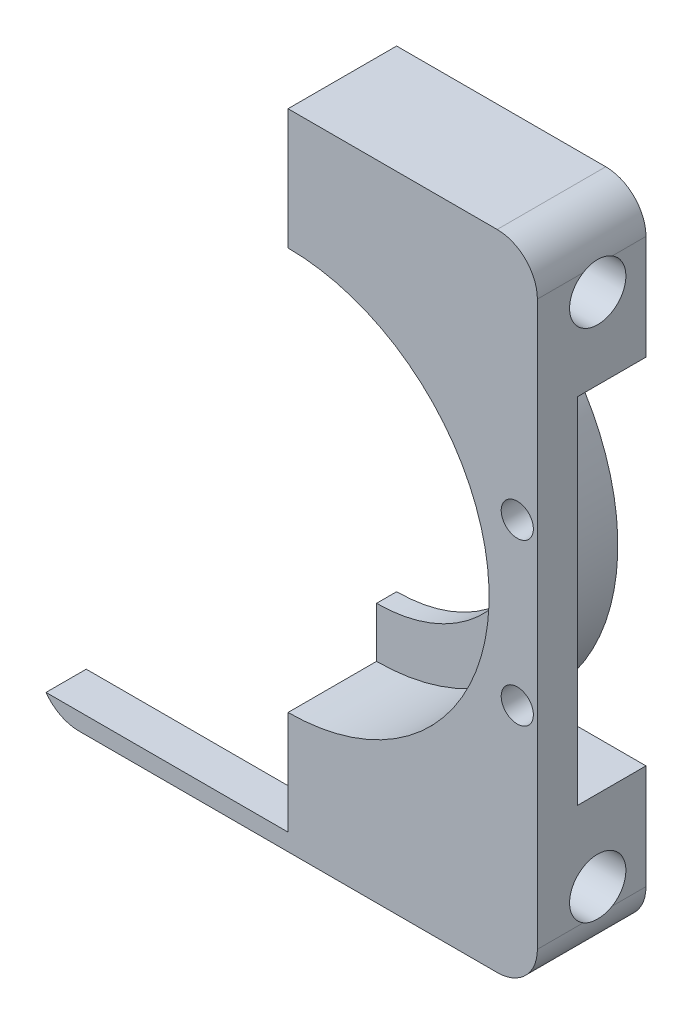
ISO-10303-21;
HEADER;
FILE_DESCRIPTION(('STEP AP214'),'2;1');
FILE_NAME('part.step','',(''),(''),'','','');
FILE_SCHEMA(('AUTOMOTIVE_DESIGN { 1 0 10303 214 1 1 1 1 }'));
ENDSEC;
DATA;
#1=APPLICATION_CONTEXT('core data for automotive mechanical design processes');
#2=APPLICATION_PROTOCOL_DEFINITION('international standard','automotive_design',2000,#1);
#3=PRODUCT_CONTEXT('',#1,'mechanical');
#4=PRODUCT('Part','Part','',(#3));
#5=PRODUCT_RELATED_PRODUCT_CATEGORY('part','',(#4));
#6=PRODUCT_DEFINITION_FORMATION('','',#4);
#7=PRODUCT_DEFINITION_CONTEXT('part definition',#1,'design');
#8=PRODUCT_DEFINITION('design','',#6,#7);
#9=PRODUCT_DEFINITION_SHAPE('','',#8);
#10=(LENGTH_UNIT() NAMED_UNIT(*) SI_UNIT(.MILLI.,.METRE.));
#11=(NAMED_UNIT(*) PLANE_ANGLE_UNIT() SI_UNIT($,.RADIAN.));
#12=(NAMED_UNIT(*) SI_UNIT($,.STERADIAN.) SOLID_ANGLE_UNIT());
#13=UNCERTAINTY_MEASURE_WITH_UNIT(LENGTH_MEASURE(1.E-05),#10,'distance_accuracy_value','');
#14=(GEOMETRIC_REPRESENTATION_CONTEXT(3) GLOBAL_UNCERTAINTY_ASSIGNED_CONTEXT((#13)) GLOBAL_UNIT_ASSIGNED_CONTEXT((#10,
#11,#12)) REPRESENTATION_CONTEXT('',''));
#15=CARTESIAN_POINT('',(0.,0.,0.));
#16=DIRECTION('',(0.,0.,1.));
#17=DIRECTION('',(1.,0.,0.));
#18=AXIS2_PLACEMENT_3D('',#15,#16,#17);
#19=CARTESIAN_POINT('',(0.,0.,0.));
#20=DIRECTION('',(1.,0.,0.));
#21=DIRECTION('',(0.,1.,0.));
#22=AXIS2_PLACEMENT_3D('',#19,#20,#21);
#23=PLANE('',#22);
#24=CARTESIAN_POINT('',(0.,310.713939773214,367.5));
#25=DIRECTION('',(-1.,0.,0.));
#26=DIRECTION('',(0.,1.,0.));
#27=AXIS2_PLACEMENT_3D('',#24,#25,#26);
#28=CIRCLE('',#27,6.99999999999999);
#29=CARTESIAN_POINT('',(0.,317.713939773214,367.5));
#30=VERTEX_POINT('',#29);
#31=EDGE_CURVE('E414',#30,#30,#28,.T.);
#32=ORIENTED_EDGE('',*,*,#31,.F.);
#33=EDGE_LOOP('',(#32));
#34=FACE_BOUND('',#33,.T.);
#35=DIRECTION('',(0.,1.,0.));
#36=VECTOR('',#35,1.);
#37=CARTESIAN_POINT('',(0.,444.713939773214,382.5));
#38=LINE('',#37,#36);
#39=CARTESIAN_POINT('',(0.,298.948444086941,382.5));
#40=VERTEX_POINT('',#39);
#41=CARTESIAN_POINT('',(0.,324.713939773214,382.5));
#42=VERTEX_POINT('',#41);
#43=EDGE_CURVE('E192',#40,#42,#38,.T.);
#44=ORIENTED_EDGE('',*,*,#43,.T.);
#45=DIRECTION('',(0.,0.,1.));
#46=VECTOR('',#45,1.);
#47=CARTESIAN_POINT('',(0.,324.713939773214,360.5));
#48=LINE('',#47,#46);
#49=CARTESIAN_POINT('',(0.,324.713939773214,360.5));
#50=VERTEX_POINT('',#49);
#51=EDGE_CURVE('E174',#42,#50,#48,.F.);
#52=ORIENTED_EDGE('',*,*,#51,.T.);
#53=DIRECTION('',(0.,-1.,0.));
#54=VECTOR('',#53,1.);
#55=CARTESIAN_POINT('',(0.,374.713939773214,360.5));
#56=LINE('',#55,#54);
#57=CARTESIAN_POINT('',(0.,337.213939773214,360.5));
#58=VERTEX_POINT('',#57);
#59=EDGE_CURVE('E352',#58,#50,#56,.T.);
#60=ORIENTED_EDGE('',*,*,#59,.F.);
#61=DIRECTION('',(0.,0.,1.));
#62=VECTOR('',#61,1.);
#63=CARTESIAN_POINT('',(0.,337.213939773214,355.5));
#64=LINE('',#63,#62);
#65=CARTESIAN_POINT('',(0.,337.213939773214,355.5));
#66=VERTEX_POINT('',#65);
#67=EDGE_CURVE('E355',#58,#66,#64,.F.);
#68=ORIENTED_EDGE('',*,*,#67,.T.);
#69=DIRECTION('',(0.,-1.,0.));
#70=VECTOR('',#69,1.);
#71=CARTESIAN_POINT('',(0.,374.713939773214,355.5));
#72=LINE('',#71,#70);
#73=CARTESIAN_POINT('',(0.,294.713939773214,355.5));
#74=VERTEX_POINT('',#73);
#75=EDGE_CURVE('E331',#66,#74,#72,.T.);
#76=ORIENTED_EDGE('',*,*,#75,.T.);
#77=DIRECTION('',(0.,0.,1.));
#78=VECTOR('',#77,1.);
#79=CARTESIAN_POINT('',(0.,294.713939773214,355.5));
#80=LINE('',#79,#78);
#81=CARTESIAN_POINT('',(0.,294.713939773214,372.5));
#82=VERTEX_POINT('',#81);
#83=EDGE_CURVE('E329',#74,#82,#80,.T.);
#84=ORIENTED_EDGE('',*,*,#83,.T.);
#85=DIRECTION('',(0.,1.,0.));
#86=VECTOR('',#85,1.);
#87=CARTESIAN_POINT('',(0.,319.713939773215,372.5));
#88=LINE('',#87,#86);
#89=CARTESIAN_POINT('',(0.,298.948444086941,372.5));
#90=VERTEX_POINT('',#89);
#91=EDGE_CURVE('E326',#82,#90,#88,.T.);
#92=ORIENTED_EDGE('',*,*,#91,.T.);
#93=DIRECTION('',(0.,0.,1.));
#94=VECTOR('',#93,1.);
#95=CARTESIAN_POINT('',(0.,298.948444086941,408.443763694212));
#96=LINE('',#95,#94);
#97=EDGE_CURVE('E200',#90,#40,#96,.T.);
#98=ORIENTED_EDGE('',*,*,#97,.T.);
#99=EDGE_LOOP('',(#44,#52,#60,#68,#76,#84,#92,#98));
#100=FACE_BOUND('',#99,.T.);
#101=ADVANCED_FACE('F45',(#34,#100),#23,.F.);
#102=CARTESIAN_POINT('',(-51.9999999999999,444.713939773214,372.5));
#103=DIRECTION('',(0.,0.,1.));
#104=DIRECTION('',(0.,-1.,0.));
#105=AXIS2_PLACEMENT_3D('',#102,#103,#104);
#106=PLANE('',#105);
#107=CARTESIAN_POINT('',(57.,394.713939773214,372.5));
#108=DIRECTION('',(0.,0.,-1.));
#109=DIRECTION('',(0.,1.,0.));
#110=AXIS2_PLACEMENT_3D('',#107,#108,#109);
#111=CIRCLE('',#110,4.00000000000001);
#112=CARTESIAN_POINT('',(57.,398.713939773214,372.5));
#113=VERTEX_POINT('',#112);
#114=EDGE_CURVE('E236',#113,#113,#111,.T.);
#115=ORIENTED_EDGE('',*,*,#114,.F.);
#116=EDGE_LOOP('',(#115));
#117=FACE_BOUND('',#116,.T.);
#118=CARTESIAN_POINT('',(57.,354.713939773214,372.5));
#119=DIRECTION('',(0.,0.,-1.));
#120=DIRECTION('',(0.,1.,0.));
#121=AXIS2_PLACEMENT_3D('',#118,#119,#120);
#122=CIRCLE('',#121,4.00000000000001);
#123=CARTESIAN_POINT('',(57.,358.713939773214,372.5));
#124=VERTEX_POINT('',#123);
#125=EDGE_CURVE('E228',#124,#124,#122,.T.);
#126=ORIENTED_EDGE('',*,*,#125,.F.);
#127=EDGE_LOOP('',(#126));
#128=FACE_BOUND('',#127,.T.);
#129=CARTESIAN_POINT('',(1.16120768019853E-13,374.713939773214,372.5));
#130=DIRECTION('',(0.,0.,1.));
#131=DIRECTION('',(0.,-1.,0.));
#132=AXIS2_PLACEMENT_3D('',#129,#130,#131);
#133=CIRCLE('',#132,55.);
#134=CARTESIAN_POINT('',(33.0000000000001,418.713939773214,372.5));
#135=VERTEX_POINT('',#134);
#136=CARTESIAN_POINT('',(33.0000000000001,330.713939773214,372.5));
#137=VERTEX_POINT('',#136);
#138=EDGE_CURVE('E185',#135,#137,#133,.F.);
#139=ORIENTED_EDGE('',*,*,#138,.F.);
#140=DIRECTION('',(1.,0.,0.));
#141=VECTOR('',#140,1.);
#142=CARTESIAN_POINT('',(62.0000000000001,418.713939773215,372.5));
#143=LINE('',#142,#141);
#144=CARTESIAN_POINT('',(62.0000000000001,418.713939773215,372.5));
#145=VERTEX_POINT('',#144);
#146=EDGE_CURVE('E563',#135,#145,#143,.T.);
#147=ORIENTED_EDGE('',*,*,#146,.T.);
#148=DIRECTION('',(0.,-1.,0.));
#149=VECTOR('',#148,1.);
#150=CARTESIAN_POINT('',(62.0000000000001,444.713939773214,372.5));
#151=LINE('',#150,#149);
#152=CARTESIAN_POINT('',(62.0000000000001,330.713939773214,372.5));
#153=VERTEX_POINT('',#152);
#154=EDGE_CURVE('E244',#145,#153,#151,.T.);
#155=ORIENTED_EDGE('',*,*,#154,.T.);
#156=DIRECTION('',(1.,0.,0.));
#157=VECTOR('',#156,1.);
#158=CARTESIAN_POINT('',(62.0000000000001,330.713939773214,372.5));
#159=LINE('',#158,#157);
#160=EDGE_CURVE('E387',#137,#153,#159,.T.);
#161=ORIENTED_EDGE('',*,*,#160,.F.);
#162=EDGE_LOOP('',(#139,#147,#155,#161));
#163=FACE_BOUND('',#162,.T.);
#164=ADVANCED_FACE('F480',(#117,#128,#163),#106,.F.);
#165=ORIENTED_EDGE('',*,*,#91,.F.);
#166=DIRECTION('',(-1.,0.,0.));
#167=VECTOR('',#166,1.);
#168=CARTESIAN_POINT('',(52.,294.713939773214,372.5));
#169=LINE('',#168,#167);
#170=CARTESIAN_POINT('',(-51.9999999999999,294.713939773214,372.5));
#171=VERTEX_POINT('',#170);
#172=EDGE_CURVE('E247',#82,#171,#169,.T.);
#173=ORIENTED_EDGE('',*,*,#172,.T.);
#174=CARTESIAN_POINT('',(-51.9999999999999,304.713939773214,372.5));
#175=DIRECTION('',(0.,0.,-1.));
#176=DIRECTION('',(0.,-1.,0.));
#177=AXIS2_PLACEMENT_3D('',#174,#175,#176);
#178=CIRCLE('',#177,10.);
#179=CARTESIAN_POINT('',(-60.1706217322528,298.948444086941,372.5));
#180=VERTEX_POINT('',#179);
#181=EDGE_CURVE('E251',#171,#180,#178,.T.);
#182=ORIENTED_EDGE('',*,*,#181,.T.);
#183=DIRECTION('',(-1.,0.,0.));
#184=VECTOR('',#183,1.);
#185=CARTESIAN_POINT('',(-52.,298.948444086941,372.5));
#186=LINE('',#185,#184);
#187=EDGE_CURVE('E206',#90,#180,#186,.T.);
#188=ORIENTED_EDGE('',*,*,#187,.F.);
#189=EDGE_LOOP('',(#165,#173,#182,#188));
#190=FACE_BOUND('',#189,.T.);
#191=ADVANCED_FACE('F325',(#190),#106,.F.);
#192=CARTESIAN_POINT('',(1.16120768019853E-13,374.713939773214,360.5));
#193=DIRECTION('',(0.,0.,1.));
#194=DIRECTION('',(0.,-1.,0.));
#195=AXIS2_PLACEMENT_3D('',#192,#193,#194);
#196=CYLINDRICAL_SURFACE('',#195,55.);
#197=CARTESIAN_POINT('',(1.16120768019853E-13,374.713939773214,355.5));
#198=DIRECTION('',(0.,0.,-1.));
#199=DIRECTION('',(0.,1.,0.));
#200=AXIS2_PLACEMENT_3D('',#197,#198,#199);
#201=CIRCLE('',#200,55.);
#202=CARTESIAN_POINT('',(33.,418.713939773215,355.5));
#203=VERTEX_POINT('',#202);
#204=CARTESIAN_POINT('',(33.0000000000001,330.713939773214,355.5));
#205=VERTEX_POINT('',#204);
#206=EDGE_CURVE('E219',#203,#205,#201,.T.);
#207=ORIENTED_EDGE('',*,*,#206,.F.);
#208=DIRECTION('',(0.,0.,1.));
#209=VECTOR('',#208,1.);
#210=CARTESIAN_POINT('',(33.0000000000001,418.713939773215,355.5));
#211=LINE('',#210,#209);
#212=EDGE_CURVE('E397',#203,#135,#211,.T.);
#213=ORIENTED_EDGE('',*,*,#212,.T.);
#214=ORIENTED_EDGE('',*,*,#138,.T.);
#215=DIRECTION('',(0.,0.,1.));
#216=VECTOR('',#215,1.);
#217=CARTESIAN_POINT('',(33.0000000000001,330.713939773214,355.5));
#218=LINE('',#217,#216);
#219=EDGE_CURVE('E340',#205,#137,#218,.T.);
#220=ORIENTED_EDGE('',*,*,#219,.F.);
#221=EDGE_LOOP('',(#207,#213,#214,#220));
#222=FACE_BOUND('',#221,.T.);
#223=ADVANCED_FACE('F469',(#222),#196,.T.);
#224=CARTESIAN_POINT('',(-51.9999999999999,444.713939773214,382.5));
#225=DIRECTION('',(0.,0.,1.));
#226=DIRECTION('',(0.,-1.,0.));
#227=AXIS2_PLACEMENT_3D('',#224,#225,#226);
#228=PLANE('',#227);
#229=CARTESIAN_POINT('',(1.16120768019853E-13,374.713939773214,382.5));
#230=DIRECTION('',(0.,0.,-1.));
#231=DIRECTION('',(0.,1.,0.));
#232=AXIS2_PLACEMENT_3D('',#229,#230,#231);
#233=CIRCLE('',#232,50.);
#234=CARTESIAN_POINT('',(0.,424.713939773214,382.5));
#235=VERTEX_POINT('',#234);
#236=EDGE_CURVE('E177',#235,#42,#233,.T.);
#237=ORIENTED_EDGE('',*,*,#236,.T.);
#238=ORIENTED_EDGE('',*,*,#43,.F.);
#239=DIRECTION('',(-1.,0.,0.));
#240=VECTOR('',#239,1.);
#241=CARTESIAN_POINT('',(-52.,298.948444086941,382.5));
#242=LINE('',#241,#240);
#243=CARTESIAN_POINT('',(-60.1706217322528,298.948444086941,382.5));
#244=VERTEX_POINT('',#243);
#245=EDGE_CURVE('E202',#40,#244,#242,.T.);
#246=ORIENTED_EDGE('',*,*,#245,.T.);
#247=CARTESIAN_POINT('',(-51.9999999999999,304.713939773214,382.5));
#248=DIRECTION('',(0.,0.,-1.));
#249=DIRECTION('',(0.,-1.,0.));
#250=AXIS2_PLACEMENT_3D('',#247,#248,#249);
#251=CIRCLE('',#250,10.);
#252=CARTESIAN_POINT('',(-51.9999999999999,294.713939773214,382.5));
#253=VERTEX_POINT('',#252);
#254=EDGE_CURVE('E248',#253,#244,#251,.T.);
#255=ORIENTED_EDGE('',*,*,#254,.F.);
#256=DIRECTION('',(-1.,0.,0.));
#257=VECTOR('',#256,1.);
#258=CARTESIAN_POINT('',(52.,294.713939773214,382.5));
#259=LINE('',#258,#257);
#260=CARTESIAN_POINT('',(52.,294.713939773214,382.5));
#261=VERTEX_POINT('',#260);
#262=EDGE_CURVE('E269',#261,#253,#259,.T.);
#263=ORIENTED_EDGE('',*,*,#262,.F.);
#264=CARTESIAN_POINT('',(52.,304.713939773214,382.5));
#265=DIRECTION('',(0.,0.,-1.));
#266=DIRECTION('',(0.,-1.,0.));
#267=AXIS2_PLACEMENT_3D('',#264,#265,#266);
#268=CIRCLE('',#267,10.);
#269=CARTESIAN_POINT('',(62.0000000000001,304.713939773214,382.5));
#270=VERTEX_POINT('',#269);
#271=EDGE_CURVE('E266',#270,#261,#268,.T.);
#272=ORIENTED_EDGE('',*,*,#271,.F.);
#273=DIRECTION('',(0.,-1.,0.));
#274=VECTOR('',#273,1.);
#275=CARTESIAN_POINT('',(62.0000000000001,444.713939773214,382.5));
#276=LINE('',#275,#274);
#277=CARTESIAN_POINT('',(62.0000000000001,444.713939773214,382.5));
#278=VERTEX_POINT('',#277);
#279=EDGE_CURVE('E262',#278,#270,#276,.T.);
#280=ORIENTED_EDGE('',*,*,#279,.F.);
#281=CARTESIAN_POINT('',(52.0000000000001,444.713939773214,382.5));
#282=DIRECTION('',(0.,0.,-1.));
#283=DIRECTION('',(0.,-1.,0.));
#284=AXIS2_PLACEMENT_3D('',#281,#282,#283);
#285=CIRCLE('',#284,10.);
#286=CARTESIAN_POINT('',(52.0000000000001,454.713939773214,382.5));
#287=VERTEX_POINT('',#286);
#288=EDGE_CURVE('E258',#287,#278,#285,.T.);
#289=ORIENTED_EDGE('',*,*,#288,.F.);
#290=DIRECTION('',(1.,0.,0.));
#291=VECTOR('',#290,1.);
#292=CARTESIAN_POINT('',(52.0000000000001,454.713939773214,382.5));
#293=LINE('',#292,#291);
#294=CARTESIAN_POINT('',(0.,454.713939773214,382.5));
#295=VERTEX_POINT('',#294);
#296=EDGE_CURVE('E240',#295,#287,#293,.T.);
#297=ORIENTED_EDGE('',*,*,#296,.F.);
#298=EDGE_CURVE('E194',#235,#295,#38,.T.);
#299=ORIENTED_EDGE('',*,*,#298,.F.);
#300=EDGE_LOOP('',(#237,#238,#246,#255,#263,#272,#280,#289,#297,#299));
#301=FACE_BOUND('',#300,.T.);
#302=CARTESIAN_POINT('',(57.,394.713939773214,382.5));
#303=DIRECTION('',(0.,0.,-1.));
#304=DIRECTION('',(0.,1.,0.));
#305=AXIS2_PLACEMENT_3D('',#302,#303,#304);
#306=CIRCLE('',#305,4.00000000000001);
#307=CARTESIAN_POINT('',(57.,398.713939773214,382.5));
#308=VERTEX_POINT('',#307);
#309=EDGE_CURVE('E232',#308,#308,#306,.T.);
#310=ORIENTED_EDGE('',*,*,#309,.T.);
#311=EDGE_LOOP('',(#310));
#312=FACE_BOUND('',#311,.T.);
#313=CARTESIAN_POINT('',(57.,354.713939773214,382.5));
#314=DIRECTION('',(0.,0.,-1.));
#315=DIRECTION('',(0.,1.,0.));
#316=AXIS2_PLACEMENT_3D('',#313,#314,#315);
#317=CIRCLE('',#316,4.00000000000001);
#318=CARTESIAN_POINT('',(57.,358.713939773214,382.5));
#319=VERTEX_POINT('',#318);
#320=EDGE_CURVE('E227',#319,#319,#317,.T.);
#321=ORIENTED_EDGE('',*,*,#320,.T.);
#322=EDGE_LOOP('',(#321));
#323=FACE_BOUND('',#322,.T.);
#324=ADVANCED_FACE('F189',(#301,#312,#323),#228,.T.);
#325=CARTESIAN_POINT('',(-51.9999999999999,304.713939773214,372.5));
#326=DIRECTION('',(0.,0.,1.));
#327=DIRECTION('',(0.,-1.,0.));
#328=AXIS2_PLACEMENT_3D('',#325,#326,#327);
#329=CYLINDRICAL_SURFACE('',#328,10.);
#330=DIRECTION('',(0.,0.,1.));
#331=VECTOR('',#330,1.);
#332=CARTESIAN_POINT('',(-60.1706217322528,298.948444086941,372.5));
#333=LINE('',#332,#331);
#334=EDGE_CURVE('E11',#180,#244,#333,.T.);
#335=ORIENTED_EDGE('',*,*,#334,.F.);
#336=ORIENTED_EDGE('',*,*,#181,.F.);
#337=DIRECTION('',(0.,0.,1.));
#338=VECTOR('',#337,1.);
#339=CARTESIAN_POINT('',(-51.9999999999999,294.713939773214,372.5));
#340=LINE('',#339,#338);
#341=EDGE_CURVE('E255',#171,#253,#340,.T.);
#342=ORIENTED_EDGE('',*,*,#341,.T.);
#343=ORIENTED_EDGE('',*,*,#254,.T.);
#344=EDGE_LOOP('',(#335,#336,#342,#343));
#345=FACE_BOUND('',#344,.T.);
#346=ADVANCED_FACE('F322',(#345),#329,.T.);
#347=CARTESIAN_POINT('',(52.0000000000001,454.713939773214,372.5));
#348=DIRECTION('',(0.,-1.,0.));
#349=DIRECTION('',(0.,0.,-1.));
#350=AXIS2_PLACEMENT_3D('',#347,#348,#349);
#351=PLANE('',#350);
#352=DIRECTION('',(0.,0.,1.));
#353=VECTOR('',#352,1.);
#354=CARTESIAN_POINT('',(52.0000000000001,454.713939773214,372.5));
#355=LINE('',#354,#353);
#356=CARTESIAN_POINT('',(52.,454.713939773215,355.5));
#357=VERTEX_POINT('',#356);
#358=EDGE_CURVE('E292',#357,#287,#355,.T.);
#359=ORIENTED_EDGE('',*,*,#358,.F.);
#360=DIRECTION('',(-1.,0.,0.));
#361=VECTOR('',#360,1.);
#362=CARTESIAN_POINT('',(52.,454.713939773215,355.5));
#363=LINE('',#362,#361);
#364=CARTESIAN_POINT('',(0.,454.713939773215,355.5));
#365=VERTEX_POINT('',#364);
#366=EDGE_CURVE('E573',#357,#365,#363,.T.);
#367=ORIENTED_EDGE('',*,*,#366,.T.);
#368=DIRECTION('',(0.,0.,1.));
#369=VECTOR('',#368,1.);
#370=CARTESIAN_POINT('',(0.,454.713939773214,372.5));
#371=LINE('',#370,#369);
#372=EDGE_CURVE('E208',#365,#295,#371,.T.);
#373=ORIENTED_EDGE('',*,*,#372,.T.);
#374=ORIENTED_EDGE('',*,*,#296,.T.);
#375=EDGE_LOOP('',(#359,#367,#373,#374));
#376=FACE_BOUND('',#375,.T.);
#377=ADVANCED_FACE('F47',(#376),#351,.F.);
#378=CARTESIAN_POINT('',(52.0000000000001,444.713939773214,372.5));
#379=DIRECTION('',(0.,0.,1.));
#380=DIRECTION('',(0.,-1.,0.));
#381=AXIS2_PLACEMENT_3D('',#378,#379,#380);
#382=CYLINDRICAL_SURFACE('',#381,10.);
#383=DIRECTION('',(0.,0.,1.));
#384=VECTOR('',#383,1.);
#385=CARTESIAN_POINT('',(62.0000000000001,444.713939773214,372.5));
#386=LINE('',#385,#384);
#387=CARTESIAN_POINT('',(62.0000000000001,444.713939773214,371.105551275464));
#388=VERTEX_POINT('',#387);
#389=EDGE_CURVE('E287',#388,#278,#386,.T.);
#390=ORIENTED_EDGE('',*,*,#389,.F.);
#391=CARTESIAN_POINT('',(62.0000000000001,444.713939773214,371.105551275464));
#392=CARTESIAN_POINT('',(61.9999752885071,444.815282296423,370.936947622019));
#393=CARTESIAN_POINT('',(61.9984580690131,444.909473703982,370.764065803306));
#394=CARTESIAN_POINT('',(61.9935720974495,445.082967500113,370.411028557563));
#395=CARTESIAN_POINT('',(61.9902035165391,445.162271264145,370.230873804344));
#396=CARTESIAN_POINT('',(61.9827512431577,445.30535739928,369.864706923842));
#397=CARTESIAN_POINT('',(61.9786681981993,445.369153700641,369.678700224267));
#398=CARTESIAN_POINT('',(61.9707047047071,445.480879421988,369.301977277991));
#399=CARTESIAN_POINT('',(61.966824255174,445.528808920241,369.111261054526));
#400=CARTESIAN_POINT('',(61.9599902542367,445.608475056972,368.72638412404));
#401=CARTESIAN_POINT('',(61.9570370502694,445.64020562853,368.532222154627));
#402=CARTESIAN_POINT('',(61.9525519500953,445.687217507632,368.141900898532));
#403=CARTESIAN_POINT('',(61.9510200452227,445.702498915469,367.945741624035));
#404=CARTESIAN_POINT('',(61.9496190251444,445.716502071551,367.552777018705));
#405=CARTESIAN_POINT('',(61.9497503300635,445.715219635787,367.355971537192));
#406=CARTESIAN_POINT('',(61.9516563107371,445.696094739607,366.963183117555));
#407=CARTESIAN_POINT('',(61.9534309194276,445.678252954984,366.767200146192));
#408=CARTESIAN_POINT('',(61.9583361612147,445.626201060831,366.377892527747));
#409=CARTESIAN_POINT('',(61.9614637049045,445.5920282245,366.184562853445));
#410=CARTESIAN_POINT('',(61.9685479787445,445.507567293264,365.801439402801));
#411=CARTESIAN_POINT('',(61.972504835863,445.457276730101,365.611646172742));
#412=CARTESIAN_POINT('',(61.9804880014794,445.341032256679,365.237255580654));
#413=CARTESIAN_POINT('',(61.9845141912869,445.275103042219,365.052650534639));
#414=CARTESIAN_POINT('',(61.9916941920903,445.128019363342,364.689681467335));
#415=CARTESIAN_POINT('',(61.9948485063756,445.04687372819,364.511313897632));
#416=CARTESIAN_POINT('',(61.9979423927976,444.92032412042,364.261496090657));
#417=CARTESIAN_POINT('',(61.9986897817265,444.880874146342,364.186990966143));
#418=CARTESIAN_POINT('',(61.9997180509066,444.799362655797,364.039550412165));
#419=CARTESIAN_POINT('',(61.9999995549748,444.757304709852,363.966613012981));
#420=CARTESIAN_POINT('',(62.0000000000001,444.713939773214,363.894448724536));
#421=B_SPLINE_CURVE_WITH_KNOTS('',3,(#391,#392,#393,#394,#395,#396,#397,#398,#399,#400,#401,
#402,#403,#404,#405,#406,#407,#408,#409,#410,#411,#412,#413,#414,#415,#416,#417,#418,#419,#420),
.UNSPECIFIED.,.F.,.F.,(4,2,2,2,2,2,2,2,2,2,2,2,2,2,4),(0.,0.589946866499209,1.17983920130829,
1.76919966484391,2.35855722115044,2.94813534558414,3.53770987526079,4.12743333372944,
4.71713272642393,5.30549259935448,5.8939426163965,6.48146949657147,7.06865651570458,
7.32153490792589,7.57407442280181),.UNSPECIFIED.);
#422=CARTESIAN_POINT('',(62.0000000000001,444.713939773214,363.894448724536));
#423=VERTEX_POINT('',#422);
#424=EDGE_CURVE('E67',#388,#423,#421,.T.);
#425=ORIENTED_EDGE('',*,*,#424,.T.);
#426=CARTESIAN_POINT('',(62.0000000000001,444.713939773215,355.5));
#427=VERTEX_POINT('',#426);
#428=EDGE_CURVE('E288',#427,#423,#386,.T.);
#429=ORIENTED_EDGE('',*,*,#428,.F.);
#430=CARTESIAN_POINT('',(52.,444.713939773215,355.5));
#431=DIRECTION('',(0.,0.,1.));
#432=DIRECTION('',(0.,-1.,0.));
#433=AXIS2_PLACEMENT_3D('',#430,#431,#432);
#434=CIRCLE('',#433,10.);
#435=EDGE_CURVE('E568',#427,#357,#434,.T.);
#436=ORIENTED_EDGE('',*,*,#435,.T.);
#437=ORIENTED_EDGE('',*,*,#358,.T.);
#438=ORIENTED_EDGE('',*,*,#288,.T.);
#439=EDGE_LOOP('',(#390,#425,#429,#436,#437,#438));
#440=FACE_BOUND('',#439,.T.);
#441=ADVANCED_FACE('F559',(#440),#382,.T.);
#442=CARTESIAN_POINT('',(62.0000000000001,444.713939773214,372.5));
#443=DIRECTION('',(-1.,0.,0.));
#444=DIRECTION('',(0.,-1.,0.));
#445=AXIS2_PLACEMENT_3D('',#442,#443,#444);
#446=PLANE('',#445);
#447=ORIENTED_EDGE('',*,*,#428,.T.);
#448=CARTESIAN_POINT('',(62.0000000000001,438.713939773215,367.5));
#449=DIRECTION('',(-1.,0.,0.));
#450=DIRECTION('',(0.,-1.,0.));
#451=AXIS2_PLACEMENT_3D('',#448,#449,#450);
#452=CIRCLE('',#451,6.99999999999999);
#453=EDGE_CURVE('E430',#423,#388,#452,.T.);
#454=ORIENTED_EDGE('',*,*,#453,.T.);
#455=ORIENTED_EDGE('',*,*,#389,.T.);
#456=ORIENTED_EDGE('',*,*,#279,.T.);
#457=DIRECTION('',(0.,0.,1.));
#458=VECTOR('',#457,1.);
#459=CARTESIAN_POINT('',(62.0000000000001,304.713939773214,372.5));
#460=LINE('',#459,#458);
#461=CARTESIAN_POINT('',(62.0000000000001,304.713939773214,371.105551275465));
#462=VERTEX_POINT('',#461);
#463=EDGE_CURVE('E282',#462,#270,#460,.T.);
#464=ORIENTED_EDGE('',*,*,#463,.F.);
#465=CARTESIAN_POINT('',(62.0000000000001,310.713939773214,367.5));
#466=DIRECTION('',(-1.,0.,0.));
#467=DIRECTION('',(0.,1.,0.));
#468=AXIS2_PLACEMENT_3D('',#465,#466,#467);
#469=CIRCLE('',#468,6.99999999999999);
#470=CARTESIAN_POINT('',(62.0000000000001,304.713939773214,363.894448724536));
#471=VERTEX_POINT('',#470);
#472=EDGE_CURVE('E196',#462,#471,#469,.T.);
#473=ORIENTED_EDGE('',*,*,#472,.T.);
#474=CARTESIAN_POINT('',(62.0000000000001,304.713939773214,355.5));
#475=VERTEX_POINT('',#474);
#476=EDGE_CURVE('E283',#475,#471,#460,.T.);
#477=ORIENTED_EDGE('',*,*,#476,.F.);
#478=DIRECTION('',(0.,-1.,0.));
#479=VECTOR('',#478,1.);
#480=CARTESIAN_POINT('',(62.0000000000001,304.713939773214,355.5));
#481=LINE('',#480,#479);
#482=CARTESIAN_POINT('',(62.0000000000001,330.713939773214,355.5));
#483=VERTEX_POINT('',#482);
#484=EDGE_CURVE('E380',#483,#475,#481,.T.);
#485=ORIENTED_EDGE('',*,*,#484,.F.);
#486=DIRECTION('',(0.,0.,1.));
#487=VECTOR('',#486,1.);
#488=CARTESIAN_POINT('',(62.0000000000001,330.713939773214,355.5));
#489=LINE('',#488,#487);
#490=EDGE_CURVE('E334',#483,#153,#489,.T.);
#491=ORIENTED_EDGE('',*,*,#490,.T.);
#492=ORIENTED_EDGE('',*,*,#154,.F.);
#493=DIRECTION('',(0.,0.,1.));
#494=VECTOR('',#493,1.);
#495=CARTESIAN_POINT('',(62.0000000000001,418.713939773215,355.5));
#496=LINE('',#495,#494);
#497=CARTESIAN_POINT('',(62.0000000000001,418.713939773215,355.5));
#498=VERTEX_POINT('',#497);
#499=EDGE_CURVE('E390',#498,#145,#496,.T.);
#500=ORIENTED_EDGE('',*,*,#499,.F.);
#501=DIRECTION('',(0.,1.,0.));
#502=VECTOR('',#501,1.);
#503=CARTESIAN_POINT('',(62.0000000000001,444.713939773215,355.5));
#504=LINE('',#503,#502);
#505=EDGE_CURVE('E566',#498,#427,#504,.T.);
#506=ORIENTED_EDGE('',*,*,#505,.T.);
#507=EDGE_LOOP('',(#447,#454,#455,#456,#464,#473,#477,#485,#491,#492,#500,#506));
#508=FACE_BOUND('',#507,.T.);
#509=ADVANCED_FACE('F309',(#508),#446,.F.);
#510=CARTESIAN_POINT('',(52.,304.713939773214,372.5));
#511=DIRECTION('',(0.,0.,1.));
#512=DIRECTION('',(0.,-1.,0.));
#513=AXIS2_PLACEMENT_3D('',#510,#511,#512);
#514=CYLINDRICAL_SURFACE('',#513,10.);
#515=ORIENTED_EDGE('',*,*,#476,.T.);
#516=CARTESIAN_POINT('',(62.0000000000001,304.713939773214,363.894448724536));
#517=CARTESIAN_POINT('',(61.9999752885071,304.612597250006,364.063052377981));
#518=CARTESIAN_POINT('',(61.9984580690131,304.518405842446,364.235934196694));
#519=CARTESIAN_POINT('',(61.9935720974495,304.344912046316,364.588971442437));
#520=CARTESIAN_POINT('',(61.9902035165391,304.265608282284,364.769126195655));
#521=CARTESIAN_POINT('',(61.9827512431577,304.122522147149,365.135293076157));
#522=CARTESIAN_POINT('',(61.9786681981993,304.058725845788,365.321299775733));
#523=CARTESIAN_POINT('',(61.9707047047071,303.947000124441,365.698022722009));
#524=CARTESIAN_POINT('',(61.966824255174,303.899070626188,365.888738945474));
#525=CARTESIAN_POINT('',(61.9599902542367,303.819404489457,366.27361587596));
#526=CARTESIAN_POINT('',(61.9570370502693,303.787673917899,366.467777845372));
#527=CARTESIAN_POINT('',(61.9525519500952,303.740662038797,366.858099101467));
#528=CARTESIAN_POINT('',(61.9510200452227,303.72538063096,367.054258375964));
#529=CARTESIAN_POINT('',(61.9496190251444,303.711377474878,367.447222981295));
#530=CARTESIAN_POINT('',(61.9497503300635,303.712659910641,367.644028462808));
#531=CARTESIAN_POINT('',(61.951656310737,303.731784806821,368.036816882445));
#532=CARTESIAN_POINT('',(61.9534309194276,303.749626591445,368.232799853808));
#533=CARTESIAN_POINT('',(61.9583361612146,303.801678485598,368.622107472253));
#534=CARTESIAN_POINT('',(61.9614637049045,303.835851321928,368.815437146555));
#535=CARTESIAN_POINT('',(61.9685479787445,303.920312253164,369.198560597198));
#536=CARTESIAN_POINT('',(61.972504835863,303.970602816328,369.388353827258));
#537=CARTESIAN_POINT('',(61.9804880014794,304.08684728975,369.762744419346));
#538=CARTESIAN_POINT('',(61.9845141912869,304.15277650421,369.947349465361));
#539=CARTESIAN_POINT('',(61.9916941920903,304.299860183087,370.310318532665));
#540=CARTESIAN_POINT('',(61.9948485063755,304.381005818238,370.488686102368));
#541=CARTESIAN_POINT('',(61.9979423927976,304.507555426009,370.738503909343));
#542=CARTESIAN_POINT('',(61.9986897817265,304.547005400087,370.813009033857));
#543=CARTESIAN_POINT('',(61.9997180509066,304.628516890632,370.960449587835));
#544=CARTESIAN_POINT('',(61.9999995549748,304.670574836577,371.03338698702));
#545=CARTESIAN_POINT('',(62.0000000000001,304.713939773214,371.105551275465));
#546=B_SPLINE_CURVE_WITH_KNOTS('',3,(#516,#517,#518,#519,#520,#521,#522,#523,#524,#525,#526,
#527,#528,#529,#530,#531,#532,#533,#534,#535,#536,#537,#538,#539,#540,#541,#542,#543,#544,#545),
.UNSPECIFIED.,.F.,.F.,(4,2,2,2,2,2,2,2,2,2,2,2,2,2,4),(0.,0.589946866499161,1.17983920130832,
1.76919966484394,2.35855722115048,2.94813534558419,3.5377098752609,4.12743333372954,
4.71713272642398,5.30549259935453,5.89394261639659,6.48146949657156,7.06865651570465,
7.32153490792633,7.5740744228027),.UNSPECIFIED.);
#547=EDGE_CURVE('E305',#471,#462,#546,.T.);
#548=ORIENTED_EDGE('',*,*,#547,.T.);
#549=ORIENTED_EDGE('',*,*,#463,.T.);
#550=ORIENTED_EDGE('',*,*,#271,.T.);
#551=DIRECTION('',(0.,0.,1.));
#552=VECTOR('',#551,1.);
#553=CARTESIAN_POINT('',(52.,294.713939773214,372.5));
#554=LINE('',#553,#552);
#555=CARTESIAN_POINT('',(52.,294.713939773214,355.5));
#556=VERTEX_POINT('',#555);
#557=EDGE_CURVE('E278',#556,#261,#554,.T.);
#558=ORIENTED_EDGE('',*,*,#557,.F.);
#559=CARTESIAN_POINT('',(52.,304.713939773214,355.5));
#560=DIRECTION('',(0.,0.,-1.));
#561=DIRECTION('',(0.,1.,0.));
#562=AXIS2_PLACEMENT_3D('',#559,#560,#561);
#563=CIRCLE('',#562,10.);
#564=EDGE_CURVE('E342',#475,#556,#563,.T.);
#565=ORIENTED_EDGE('',*,*,#564,.F.);
#566=EDGE_LOOP('',(#515,#548,#549,#550,#558,#565));
#567=FACE_BOUND('',#566,.T.);
#568=ADVANCED_FACE('F303',(#567),#514,.T.);
#569=CARTESIAN_POINT('',(52.,294.713939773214,372.5));
#570=DIRECTION('',(0.,1.,0.));
#571=DIRECTION('',(0.,0.,1.));
#572=AXIS2_PLACEMENT_3D('',#569,#570,#571);
#573=PLANE('',#572);
#574=ORIENTED_EDGE('',*,*,#262,.T.);
#575=ORIENTED_EDGE('',*,*,#341,.F.);
#576=ORIENTED_EDGE('',*,*,#172,.F.);
#577=ORIENTED_EDGE('',*,*,#83,.F.);
#578=DIRECTION('',(-1.,0.,0.));
#579=VECTOR('',#578,1.);
#580=CARTESIAN_POINT('',(52.,294.713939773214,355.5));
#581=LINE('',#580,#579);
#582=EDGE_CURVE('E335',#556,#74,#581,.T.);
#583=ORIENTED_EDGE('',*,*,#582,.F.);
#584=ORIENTED_EDGE('',*,*,#557,.T.);
#585=EDGE_LOOP('',(#574,#575,#576,#577,#583,#584));
#586=FACE_BOUND('',#585,.T.);
#587=ADVANCED_FACE('F316',(#586),#573,.F.);
#588=CARTESIAN_POINT('',(57.,394.713939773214,372.5));
#589=DIRECTION('',(0.,0.,1.));
#590=DIRECTION('',(0.,-1.,0.));
#591=AXIS2_PLACEMENT_3D('',#588,#589,#590);
#592=CYLINDRICAL_SURFACE('',#591,4.00000000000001);
#593=ORIENTED_EDGE('',*,*,#114,.T.);
#594=EDGE_LOOP('',(#593));
#595=FACE_BOUND('',#594,.T.);
#596=ORIENTED_EDGE('',*,*,#309,.F.);
#597=EDGE_LOOP('',(#596));
#598=FACE_BOUND('',#597,.T.);
#599=ADVANCED_FACE('F475',(#595,#598),#592,.F.);
#600=CARTESIAN_POINT('',(57.,354.713939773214,372.5));
#601=DIRECTION('',(0.,0.,1.));
#602=DIRECTION('',(0.,-1.,0.));
#603=AXIS2_PLACEMENT_3D('',#600,#601,#602);
#604=CYLINDRICAL_SURFACE('',#603,4.00000000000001);
#605=ORIENTED_EDGE('',*,*,#125,.T.);
#606=EDGE_LOOP('',(#605));
#607=FACE_BOUND('',#606,.T.);
#608=ORIENTED_EDGE('',*,*,#320,.F.);
#609=EDGE_LOOP('',(#608));
#610=FACE_BOUND('',#609,.T.);
#611=ADVANCED_FACE('F466',(#607,#610),#604,.F.);
#612=CARTESIAN_POINT('',(1.16120768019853E-13,374.713939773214,360.5));
#613=DIRECTION('',(0.,0.,-1.));
#614=DIRECTION('',(0.,1.,0.));
#615=AXIS2_PLACEMENT_3D('',#612,#613,#614);
#616=PLANE('',#615);
#617=CARTESIAN_POINT('',(1.16120768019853E-13,374.713939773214,360.5));
#618=DIRECTION('',(0.,0.,-1.));
#619=DIRECTION('',(0.,1.,0.));
#620=AXIS2_PLACEMENT_3D('',#617,#618,#619);
#621=CIRCLE('',#620,50.);
#622=CARTESIAN_POINT('',(0.,424.713939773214,360.5));
#623=VERTEX_POINT('',#622);
#624=EDGE_CURVE('E180',#623,#50,#621,.T.);
#625=ORIENTED_EDGE('',*,*,#624,.F.);
#626=CARTESIAN_POINT('',(0.,412.213939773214,360.5));
#627=VERTEX_POINT('',#626);
#628=EDGE_CURVE('E356',#623,#627,#56,.T.);
#629=ORIENTED_EDGE('',*,*,#628,.T.);
#630=CARTESIAN_POINT('',(1.16120768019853E-13,374.713939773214,360.5));
#631=DIRECTION('',(0.,0.,-1.));
#632=DIRECTION('',(0.,1.,0.));
#633=AXIS2_PLACEMENT_3D('',#630,#631,#632);
#634=CIRCLE('',#633,37.5);
#635=EDGE_CURVE('E214',#627,#58,#634,.T.);
#636=ORIENTED_EDGE('',*,*,#635,.T.);
#637=ORIENTED_EDGE('',*,*,#59,.T.);
#638=EDGE_LOOP('',(#625,#629,#636,#637));
#639=FACE_BOUND('',#638,.T.);
#640=ADVANCED_FACE('F369',(#639),#616,.F.);
#641=CARTESIAN_POINT('',(1.16120768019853E-13,374.713939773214,355.5));
#642=DIRECTION('',(0.,0.,-1.));
#643=DIRECTION('',(0.,1.,0.));
#644=AXIS2_PLACEMENT_3D('',#641,#642,#643);
#645=PLANE('',#644);
#646=CARTESIAN_POINT('',(0.,412.213939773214,355.5));
#647=VERTEX_POINT('',#646);
#648=EDGE_CURVE('E360',#365,#647,#72,.T.);
#649=ORIENTED_EDGE('',*,*,#648,.F.);
#650=ORIENTED_EDGE('',*,*,#366,.F.);
#651=ORIENTED_EDGE('',*,*,#435,.F.);
#652=ORIENTED_EDGE('',*,*,#505,.F.);
#653=DIRECTION('',(1.,0.,0.));
#654=VECTOR('',#653,1.);
#655=CARTESIAN_POINT('',(62.0000000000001,418.713939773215,355.5));
#656=LINE('',#655,#654);
#657=EDGE_CURVE('E403',#203,#498,#656,.T.);
#658=ORIENTED_EDGE('',*,*,#657,.F.);
#659=ORIENTED_EDGE('',*,*,#206,.T.);
#660=DIRECTION('',(1.,0.,0.));
#661=VECTOR('',#660,1.);
#662=CARTESIAN_POINT('',(62.0000000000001,330.713939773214,355.5));
#663=LINE('',#662,#661);
#664=EDGE_CURVE('E384',#205,#483,#663,.T.);
#665=ORIENTED_EDGE('',*,*,#664,.T.);
#666=ORIENTED_EDGE('',*,*,#484,.T.);
#667=ORIENTED_EDGE('',*,*,#564,.T.);
#668=ORIENTED_EDGE('',*,*,#582,.T.);
#669=ORIENTED_EDGE('',*,*,#75,.F.);
#670=CARTESIAN_POINT('',(1.16120768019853E-13,374.713939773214,355.5));
#671=DIRECTION('',(0.,0.,-1.));
#672=DIRECTION('',(0.,1.,0.));
#673=AXIS2_PLACEMENT_3D('',#670,#671,#672);
#674=CIRCLE('',#673,37.5);
#675=EDGE_CURVE('E215',#647,#66,#674,.T.);
#676=ORIENTED_EDGE('',*,*,#675,.F.);
#677=EDGE_LOOP('',(#649,#650,#651,#652,#658,#659,#665,#666,#667,#668,#669,#676));
#678=FACE_BOUND('',#677,.T.);
#679=ADVANCED_FACE('F375',(#678),#645,.T.);
#680=CARTESIAN_POINT('',(1.16120768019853E-13,374.713939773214,355.5));
#681=DIRECTION('',(0.,0.,1.));
#682=DIRECTION('',(0.,-1.,0.));
#683=AXIS2_PLACEMENT_3D('',#680,#681,#682);
#684=CYLINDRICAL_SURFACE('',#683,37.5);
#685=DIRECTION('',(0.,0.,1.));
#686=VECTOR('',#685,1.);
#687=CARTESIAN_POINT('',(0.,412.213939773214,355.5));
#688=LINE('',#687,#686);
#689=EDGE_CURVE('E361',#647,#627,#688,.T.);
#690=ORIENTED_EDGE('',*,*,#689,.F.);
#691=ORIENTED_EDGE('',*,*,#675,.T.);
#692=ORIENTED_EDGE('',*,*,#67,.F.);
#693=ORIENTED_EDGE('',*,*,#635,.F.);
#694=EDGE_LOOP('',(#690,#691,#692,#693));
#695=FACE_BOUND('',#694,.T.);
#696=ADVANCED_FACE('F372',(#695),#684,.F.);
#697=CARTESIAN_POINT('',(1.16120768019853E-13,374.713939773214,360.5));
#698=DIRECTION('',(0.,0.,1.));
#699=DIRECTION('',(0.,-1.,0.));
#700=AXIS2_PLACEMENT_3D('',#697,#698,#699);
#701=CYLINDRICAL_SURFACE('',#700,50.);
#702=DIRECTION('',(0.,0.,1.));
#703=VECTOR('',#702,1.);
#704=CARTESIAN_POINT('',(0.,424.713939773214,360.5));
#705=LINE('',#704,#703);
#706=EDGE_CURVE('E54',#623,#235,#705,.T.);
#707=ORIENTED_EDGE('',*,*,#706,.F.);
#708=ORIENTED_EDGE('',*,*,#624,.T.);
#709=ORIENTED_EDGE('',*,*,#51,.F.);
#710=ORIENTED_EDGE('',*,*,#236,.F.);
#711=EDGE_LOOP('',(#707,#708,#709,#710));
#712=FACE_BOUND('',#711,.T.);
#713=ADVANCED_FACE('F176',(#712),#701,.F.);
#714=CARTESIAN_POINT('',(-62.,298.948444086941,408.443763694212));
#715=DIRECTION('',(0.,1.,0.));
#716=DIRECTION('',(-1.,0.,0.));
#717=AXIS2_PLACEMENT_3D('',#714,#715,#716);
#718=PLANE('',#717);
#719=ORIENTED_EDGE('',*,*,#187,.T.);
#720=ORIENTED_EDGE('',*,*,#334,.T.);
#721=ORIENTED_EDGE('',*,*,#245,.F.);
#722=ORIENTED_EDGE('',*,*,#97,.F.);
#723=EDGE_LOOP('',(#719,#720,#721,#722));
#724=FACE_BOUND('',#723,.T.);
#725=ADVANCED_FACE('F455',(#724),#718,.T.);
#726=CARTESIAN_POINT('',(0.,438.713939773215,367.5));
#727=DIRECTION('',(-1.,0.,0.));
#728=DIRECTION('',(0.,-1.,0.));
#729=AXIS2_PLACEMENT_3D('',#726,#727,#728);
#730=CIRCLE('',#729,6.99999999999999);
#731=CARTESIAN_POINT('',(0.,431.713939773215,367.5));
#732=VERTEX_POINT('',#731);
#733=EDGE_CURVE('E418',#732,#732,#730,.T.);
#734=ORIENTED_EDGE('',*,*,#733,.F.);
#735=EDGE_LOOP('',(#734));
#736=FACE_BOUND('',#735,.T.);
#737=ORIENTED_EDGE('',*,*,#706,.T.);
#738=ORIENTED_EDGE('',*,*,#298,.T.);
#739=ORIENTED_EDGE('',*,*,#372,.F.);
#740=ORIENTED_EDGE('',*,*,#648,.T.);
#741=ORIENTED_EDGE('',*,*,#689,.T.);
#742=ORIENTED_EDGE('',*,*,#628,.F.);
#743=EDGE_LOOP('',(#737,#738,#739,#740,#741,#742));
#744=FACE_BOUND('',#743,.T.);
#745=ADVANCED_FACE('F452',(#736,#744),#23,.F.);
#746=CARTESIAN_POINT('',(62.0000000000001,330.713939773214,355.5));
#747=DIRECTION('',(0.,-1.,0.));
#748=DIRECTION('',(0.,0.,-1.));
#749=AXIS2_PLACEMENT_3D('',#746,#747,#748);
#750=PLANE('',#749);
#751=ORIENTED_EDGE('',*,*,#160,.T.);
#752=ORIENTED_EDGE('',*,*,#490,.F.);
#753=ORIENTED_EDGE('',*,*,#664,.F.);
#754=ORIENTED_EDGE('',*,*,#219,.T.);
#755=EDGE_LOOP('',(#751,#752,#753,#754));
#756=FACE_BOUND('',#755,.T.);
#757=ADVANCED_FACE('F410',(#756),#750,.F.);
#758=CARTESIAN_POINT('',(62.0000000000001,418.713939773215,355.5));
#759=DIRECTION('',(0.,-1.,0.));
#760=DIRECTION('',(0.,0.,-1.));
#761=AXIS2_PLACEMENT_3D('',#758,#759,#760);
#762=PLANE('',#761);
#763=ORIENTED_EDGE('',*,*,#146,.F.);
#764=ORIENTED_EDGE('',*,*,#212,.F.);
#765=ORIENTED_EDGE('',*,*,#657,.T.);
#766=ORIENTED_EDGE('',*,*,#499,.T.);
#767=EDGE_LOOP('',(#763,#764,#765,#766));
#768=FACE_BOUND('',#767,.T.);
#769=ADVANCED_FACE('F445',(#768),#762,.T.);
#770=CARTESIAN_POINT('',(62.0000000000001,310.713939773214,367.5));
#771=DIRECTION('',(-1.,0.,0.));
#772=DIRECTION('',(0.,-1.,0.));
#773=AXIS2_PLACEMENT_3D('',#770,#771,#772);
#774=CYLINDRICAL_SURFACE('',#773,6.99999999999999);
#775=ORIENTED_EDGE('',*,*,#31,.T.);
#776=EDGE_LOOP('',(#775));
#777=FACE_BOUND('',#776,.T.);
#778=ORIENTED_EDGE('',*,*,#472,.F.);
#779=ORIENTED_EDGE('',*,*,#547,.F.);
#780=EDGE_LOOP('',(#778,#779));
#781=FACE_BOUND('',#780,.T.);
#782=ADVANCED_FACE('F440',(#777,#781),#774,.F.);
#783=CARTESIAN_POINT('',(62.0000000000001,438.713939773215,367.5));
#784=DIRECTION('',(-1.,0.,0.));
#785=DIRECTION('',(0.,-1.,0.));
#786=AXIS2_PLACEMENT_3D('',#783,#784,#785);
#787=CYLINDRICAL_SURFACE('',#786,6.99999999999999);
#788=ORIENTED_EDGE('',*,*,#733,.T.);
#789=EDGE_LOOP('',(#788));
#790=FACE_BOUND('',#789,.T.);
#791=ORIENTED_EDGE('',*,*,#453,.F.);
#792=ORIENTED_EDGE('',*,*,#424,.F.);
#793=EDGE_LOOP('',(#791,#792));
#794=FACE_BOUND('',#793,.T.);
#795=ADVANCED_FACE('F444',(#790,#794),#787,.F.);
#796=CLOSED_SHELL('',(#101,#164,#191,#223,#324,#346,#377,#441,#509,#568,#587,#599,#611,#640,
#679,#696,#713,#725,#745,#757,#769,#782,#795));
#797=MANIFOLD_SOLID_BREP('B2',#796);
#798=ADVANCED_BREP_SHAPE_REPRESENTATION('',(#18,#797),#14);
#799=SHAPE_DEFINITION_REPRESENTATION(#9,#798);
ENDSEC;
END-ISO-10303-21;
